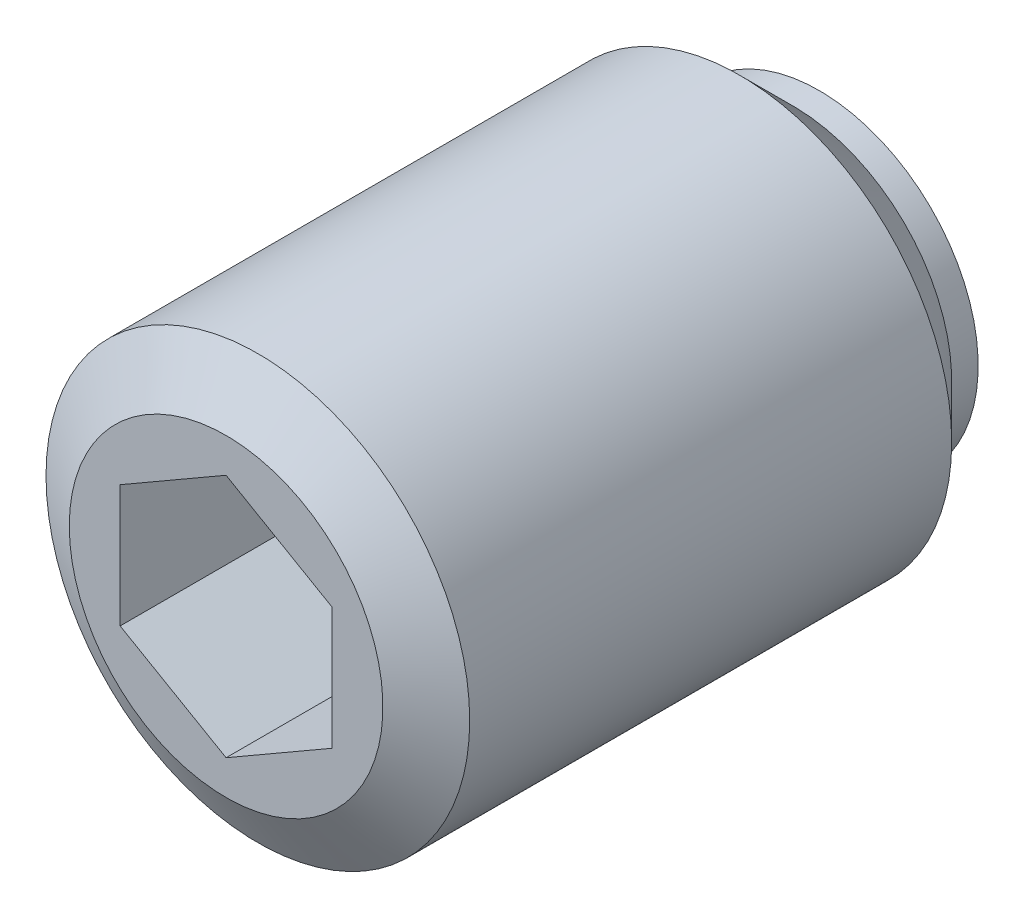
ISO-10303-21;
HEADER;
FILE_DESCRIPTION(('STEP AP214'),'2;1');
FILE_NAME('part.step','',(''),(''),'','','');
FILE_SCHEMA(('AUTOMOTIVE_DESIGN { 1 0 10303 214 1 1 1 1 }'));
ENDSEC;
DATA;
#1=APPLICATION_CONTEXT('core data for automotive mechanical design processes');
#2=APPLICATION_PROTOCOL_DEFINITION('international standard','automotive_design',2000,#1);
#3=PRODUCT_CONTEXT('',#1,'mechanical');
#4=PRODUCT('Part','Part','',(#3));
#5=PRODUCT_RELATED_PRODUCT_CATEGORY('part','',(#4));
#6=PRODUCT_DEFINITION_FORMATION('','',#4);
#7=PRODUCT_DEFINITION_CONTEXT('part definition',#1,'design');
#8=PRODUCT_DEFINITION('design','',#6,#7);
#9=PRODUCT_DEFINITION_SHAPE('','',#8);
#10=(LENGTH_UNIT() NAMED_UNIT(*) SI_UNIT(.MILLI.,.METRE.));
#11=(NAMED_UNIT(*) PLANE_ANGLE_UNIT() SI_UNIT($,.RADIAN.));
#12=(NAMED_UNIT(*) SI_UNIT($,.STERADIAN.) SOLID_ANGLE_UNIT());
#13=UNCERTAINTY_MEASURE_WITH_UNIT(LENGTH_MEASURE(1.E-05),#10,'distance_accuracy_value','');
#14=(GEOMETRIC_REPRESENTATION_CONTEXT(3) GLOBAL_UNCERTAINTY_ASSIGNED_CONTEXT((#13)) GLOBAL_UNIT_ASSIGNED_CONTEXT((#10,
#11,#12)) REPRESENTATION_CONTEXT('',''));
#15=CARTESIAN_POINT('',(0.,0.,0.));
#16=DIRECTION('',(0.,0.,1.));
#17=DIRECTION('',(1.,0.,0.));
#18=AXIS2_PLACEMENT_3D('',#15,#16,#17);
#19=CARTESIAN_POINT('',(0.,0.,1.25));
#20=DIRECTION('',(0.,0.,1.));
#21=DIRECTION('',(0.,-1.,0.));
#22=AXIS2_PLACEMENT_3D('',#19,#20,#21);
#23=SPHERICAL_SURFACE('',#22,1.25);
#24=CARTESIAN_POINT('',(0.,0.,0.4));
#25=DIRECTION('',(0.,0.,1.));
#26=DIRECTION('',(-1.,0.,0.));
#27=AXIS2_PLACEMENT_3D('',#24,#25,#26);
#28=CIRCLE('',#27,0.916515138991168);
#29=CARTESIAN_POINT('',(-0.916515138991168,0.,0.4));
#30=VERTEX_POINT('',#29);
#31=EDGE_CURVE('E9',#30,#30,#28,.T.);
#32=ORIENTED_EDGE('',*,*,#31,.F.);
#33=EDGE_LOOP('',(#32));
#34=FACE_BOUND('',#33,.T.);
#35=ADVANCED_FACE('F14',(#34),#23,.T.);
#36=CARTESIAN_POINT('',(0.,1.5,0.4));
#37=DIRECTION('',(0.,0.,1.));
#38=DIRECTION('',(-1.,0.,0.));
#39=AXIS2_PLACEMENT_3D('',#36,#37,#38);
#40=PLANE('',#39);
#41=CARTESIAN_POINT('',(0.,0.,0.4));
#42=DIRECTION('',(0.,0.,1.));
#43=DIRECTION('',(-1.,0.,0.));
#44=AXIS2_PLACEMENT_3D('',#41,#42,#43);
#45=CIRCLE('',#44,1.5);
#46=CARTESIAN_POINT('',(-1.5,0.,0.4));
#47=VERTEX_POINT('',#46);
#48=EDGE_CURVE('E21',#47,#47,#45,.T.);
#49=ORIENTED_EDGE('',*,*,#48,.F.);
#50=EDGE_LOOP('',(#49));
#51=FACE_BOUND('',#50,.T.);
#52=ORIENTED_EDGE('',*,*,#31,.T.);
#53=EDGE_LOOP('',(#52));
#54=FACE_BOUND('',#53,.T.);
#55=ADVANCED_FACE('F138',(#51,#54),#40,.F.);
#56=CARTESIAN_POINT('',(0.,0.,7.39507492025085));
#57=DIRECTION('',(0.,0.,1.));
#58=DIRECTION('',(-1.,0.,0.));
#59=AXIS2_PLACEMENT_3D('',#56,#57,#58);
#60=CYLINDRICAL_SURFACE('',#59,1.5);
#61=CARTESIAN_POINT('',(0.,0.,0.65));
#62=DIRECTION('',(0.,0.,1.));
#63=DIRECTION('',(-1.,0.,0.));
#64=AXIS2_PLACEMENT_3D('',#61,#62,#63);
#65=CIRCLE('',#64,1.5);
#66=CARTESIAN_POINT('',(-1.5,0.,0.65));
#67=VERTEX_POINT('',#66);
#68=EDGE_CURVE('E131',#67,#67,#65,.T.);
#69=ORIENTED_EDGE('',*,*,#68,.F.);
#70=EDGE_LOOP('',(#69));
#71=FACE_BOUND('',#70,.T.);
#72=ORIENTED_EDGE('',*,*,#48,.T.);
#73=EDGE_LOOP('',(#72));
#74=FACE_BOUND('',#73,.T.);
#75=ADVANCED_FACE('F136',(#71,#74),#60,.T.);
#76=CARTESIAN_POINT('',(0.,0.,0.65));
#77=DIRECTION('',(0.,0.,1.));
#78=DIRECTION('',(-1.,0.,0.));
#79=AXIS2_PLACEMENT_3D('',#76,#77,#78);
#80=CONICAL_SURFACE('',#79,1.5,0.785398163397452);
#81=CARTESIAN_POINT('',(0.,0.,1.15));
#82=DIRECTION('',(0.,0.,1.));
#83=DIRECTION('',(-1.,0.,0.));
#84=AXIS2_PLACEMENT_3D('',#81,#82,#83);
#85=CIRCLE('',#84,2.);
#86=CARTESIAN_POINT('',(-2.,0.,1.15));
#87=VERTEX_POINT('',#86);
#88=EDGE_CURVE('E128',#87,#87,#85,.T.);
#89=ORIENTED_EDGE('',*,*,#88,.F.);
#90=EDGE_LOOP('',(#89));
#91=FACE_BOUND('',#90,.T.);
#92=ORIENTED_EDGE('',*,*,#68,.T.);
#93=EDGE_LOOP('',(#92));
#94=FACE_BOUND('',#93,.T.);
#95=ADVANCED_FACE('F161',(#91,#94),#80,.T.);
#96=CARTESIAN_POINT('',(0.,0.,7.39507492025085));
#97=DIRECTION('',(0.,0.,1.));
#98=DIRECTION('',(-1.,0.,0.));
#99=AXIS2_PLACEMENT_3D('',#96,#97,#98);
#100=CYLINDRICAL_SURFACE('',#99,2.);
#101=CARTESIAN_POINT('',(0.,0.,5.7));
#102=DIRECTION('',(0.,0.,1.));
#103=DIRECTION('',(-1.,0.,0.));
#104=AXIS2_PLACEMENT_3D('',#101,#102,#103);
#105=CIRCLE('',#104,2.);
#106=CARTESIAN_POINT('',(-2.,0.,5.7));
#107=VERTEX_POINT('',#106);
#108=EDGE_CURVE('E125',#107,#107,#105,.T.);
#109=ORIENTED_EDGE('',*,*,#108,.F.);
#110=EDGE_LOOP('',(#109));
#111=FACE_BOUND('',#110,.T.);
#112=ORIENTED_EDGE('',*,*,#88,.T.);
#113=EDGE_LOOP('',(#112));
#114=FACE_BOUND('',#113,.T.);
#115=ADVANCED_FACE('F170',(#111,#114),#100,.T.);
#116=CARTESIAN_POINT('',(0.,0.,5.7));
#117=DIRECTION('',(0.,0.,-1.));
#118=DIRECTION('',(1.,0.,0.));
#119=AXIS2_PLACEMENT_3D('',#116,#117,#118);
#120=CONICAL_SURFACE('',#119,2.,1.04719755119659);
#121=CARTESIAN_POINT('',(0.,0.,6.));
#122=DIRECTION('',(0.,0.,1.));
#123=DIRECTION('',(-1.,0.,0.));
#124=AXIS2_PLACEMENT_3D('',#121,#122,#123);
#125=CIRCLE('',#124,1.48038475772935);
#126=CARTESIAN_POINT('',(-1.48038475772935,0.,6.));
#127=VERTEX_POINT('',#126);
#128=EDGE_CURVE('E116',#127,#127,#125,.T.);
#129=ORIENTED_EDGE('',*,*,#128,.F.);
#130=EDGE_LOOP('',(#129));
#131=FACE_BOUND('',#130,.T.);
#132=ORIENTED_EDGE('',*,*,#108,.T.);
#133=EDGE_LOOP('',(#132));
#134=FACE_BOUND('',#133,.T.);
#135=ADVANCED_FACE('F179',(#131,#134),#120,.T.);
#136=CARTESIAN_POINT('',(0.,0.,6.));
#137=DIRECTION('',(0.,0.,-1.));
#138=DIRECTION('',(1.,0.,0.));
#139=AXIS2_PLACEMENT_3D('',#136,#137,#138);
#140=PLANE('',#139);
#141=DIRECTION('',(-0.866025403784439,-0.5,0.));
#142=VECTOR('',#141,1.);
#143=CARTESIAN_POINT('',(0.,1.15470053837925,6.));
#144=LINE('',#143,#142);
#145=CARTESIAN_POINT('',(0.,1.15470053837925,6.));
#146=VERTEX_POINT('',#145);
#147=CARTESIAN_POINT('',(-1.,0.577350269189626,6.));
#148=VERTEX_POINT('',#147);
#149=EDGE_CURVE('E82',#146,#148,#144,.T.);
#150=ORIENTED_EDGE('',*,*,#149,.F.);
#151=DIRECTION('',(-0.866025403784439,0.5,0.));
#152=VECTOR('',#151,1.);
#153=CARTESIAN_POINT('',(1.,0.577350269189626,6.));
#154=LINE('',#153,#152);
#155=CARTESIAN_POINT('',(1.,0.577350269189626,6.));
#156=VERTEX_POINT('',#155);
#157=EDGE_CURVE('E28',#156,#146,#154,.T.);
#158=ORIENTED_EDGE('',*,*,#157,.F.);
#159=DIRECTION('',(0.,1.,0.));
#160=VECTOR('',#159,1.);
#161=CARTESIAN_POINT('',(1.,-0.577350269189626,6.));
#162=LINE('',#161,#160);
#163=CARTESIAN_POINT('',(1.,-0.577350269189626,6.));
#164=VERTEX_POINT('',#163);
#165=EDGE_CURVE('E98',#164,#156,#162,.T.);
#166=ORIENTED_EDGE('',*,*,#165,.F.);
#167=DIRECTION('',(0.866025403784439,0.5,0.));
#168=VECTOR('',#167,1.);
#169=CARTESIAN_POINT('',(0.,-1.15470053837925,6.));
#170=LINE('',#169,#168);
#171=CARTESIAN_POINT('',(0.,-1.15470053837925,6.));
#172=VERTEX_POINT('',#171);
#173=EDGE_CURVE('E92',#172,#164,#170,.T.);
#174=ORIENTED_EDGE('',*,*,#173,.F.);
#175=DIRECTION('',(0.866025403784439,-0.5,0.));
#176=VECTOR('',#175,1.);
#177=CARTESIAN_POINT('',(-1.,-0.577350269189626,6.));
#178=LINE('',#177,#176);
#179=CARTESIAN_POINT('',(-1.,-0.577350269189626,6.));
#180=VERTEX_POINT('',#179);
#181=EDGE_CURVE('E90',#180,#172,#178,.T.);
#182=ORIENTED_EDGE('',*,*,#181,.F.);
#183=DIRECTION('',(0.,-1.,0.));
#184=VECTOR('',#183,1.);
#185=CARTESIAN_POINT('',(-1.,0.577350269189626,6.));
#186=LINE('',#185,#184);
#187=EDGE_CURVE('E71',#148,#180,#186,.T.);
#188=ORIENTED_EDGE('',*,*,#187,.F.);
#189=EDGE_LOOP('',(#150,#158,#166,#174,#182,#188));
#190=FACE_BOUND('',#189,.T.);
#191=ORIENTED_EDGE('',*,*,#128,.T.);
#192=EDGE_LOOP('',(#191));
#193=FACE_BOUND('',#192,.T.);
#194=ADVANCED_FACE('F86',(#190,#193),#140,.F.);
#195=CARTESIAN_POINT('',(1.,0.577350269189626,4.));
#196=DIRECTION('',(0.5,0.866025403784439,0.));
#197=DIRECTION('',(0.866025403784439,-0.5,0.));
#198=AXIS2_PLACEMENT_3D('',#195,#196,#197);
#199=PLANE('',#198);
#200=ORIENTED_EDGE('',*,*,#157,.T.);
#201=DIRECTION('',(0.,0.,1.));
#202=VECTOR('',#201,1.);
#203=CARTESIAN_POINT('',(0.,1.15470053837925,4.));
#204=LINE('',#203,#202);
#205=CARTESIAN_POINT('',(0.,1.15470053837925,4.));
#206=VERTEX_POINT('',#205);
#207=EDGE_CURVE('E79',#206,#146,#204,.T.);
#208=ORIENTED_EDGE('',*,*,#207,.F.);
#209=DIRECTION('',(-0.866025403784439,0.5,0.));
#210=VECTOR('',#209,1.);
#211=CARTESIAN_POINT('',(1.,0.577350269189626,4.));
#212=LINE('',#211,#210);
#213=CARTESIAN_POINT('',(1.,0.577350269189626,4.));
#214=VERTEX_POINT('',#213);
#215=EDGE_CURVE('E100',#214,#206,#212,.T.);
#216=ORIENTED_EDGE('',*,*,#215,.F.);
#217=DIRECTION('',(0.,0.,1.));
#218=VECTOR('',#217,1.);
#219=CARTESIAN_POINT('',(1.,0.577350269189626,4.));
#220=LINE('',#219,#218);
#221=EDGE_CURVE('E35',#214,#156,#220,.T.);
#222=ORIENTED_EDGE('',*,*,#221,.T.);
#223=EDGE_LOOP('',(#200,#208,#216,#222));
#224=FACE_BOUND('',#223,.T.);
#225=ADVANCED_FACE('F196',(#224),#199,.F.);
#226=CARTESIAN_POINT('',(1.,-0.577350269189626,4.));
#227=DIRECTION('',(1.,0.,0.));
#228=DIRECTION('',(0.,-1.,0.));
#229=AXIS2_PLACEMENT_3D('',#226,#227,#228);
#230=PLANE('',#229);
#231=ORIENTED_EDGE('',*,*,#165,.T.);
#232=ORIENTED_EDGE('',*,*,#221,.F.);
#233=DIRECTION('',(0.,1.,0.));
#234=VECTOR('',#233,1.);
#235=CARTESIAN_POINT('',(1.,-0.577350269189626,4.));
#236=LINE('',#235,#234);
#237=CARTESIAN_POINT('',(1.,-0.577350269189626,4.));
#238=VERTEX_POINT('',#237);
#239=EDGE_CURVE('E112',#238,#214,#236,.T.);
#240=ORIENTED_EDGE('',*,*,#239,.F.);
#241=DIRECTION('',(0.,0.,1.));
#242=VECTOR('',#241,1.);
#243=CARTESIAN_POINT('',(1.,-0.577350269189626,4.));
#244=LINE('',#243,#242);
#245=EDGE_CURVE('E117',#238,#164,#244,.T.);
#246=ORIENTED_EDGE('',*,*,#245,.T.);
#247=EDGE_LOOP('',(#231,#232,#240,#246));
#248=FACE_BOUND('',#247,.T.);
#249=ADVANCED_FACE('F204',(#248),#230,.F.);
#250=CARTESIAN_POINT('',(0.,-1.15470053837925,4.));
#251=DIRECTION('',(0.5,-0.866025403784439,0.));
#252=DIRECTION('',(-0.866025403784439,-0.5,0.));
#253=AXIS2_PLACEMENT_3D('',#250,#251,#252);
#254=PLANE('',#253);
#255=ORIENTED_EDGE('',*,*,#173,.T.);
#256=ORIENTED_EDGE('',*,*,#245,.F.);
#257=DIRECTION('',(0.866025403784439,0.5,0.));
#258=VECTOR('',#257,1.);
#259=CARTESIAN_POINT('',(0.,-1.15470053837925,4.));
#260=LINE('',#259,#258);
#261=CARTESIAN_POINT('',(0.,-1.15470053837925,4.));
#262=VERTEX_POINT('',#261);
#263=EDGE_CURVE('E109',#262,#238,#260,.T.);
#264=ORIENTED_EDGE('',*,*,#263,.F.);
#265=DIRECTION('',(0.,0.,1.));
#266=VECTOR('',#265,1.);
#267=CARTESIAN_POINT('',(0.,-1.15470053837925,4.));
#268=LINE('',#267,#266);
#269=EDGE_CURVE('E119',#262,#172,#268,.T.);
#270=ORIENTED_EDGE('',*,*,#269,.T.);
#271=EDGE_LOOP('',(#255,#256,#264,#270));
#272=FACE_BOUND('',#271,.T.);
#273=ADVANCED_FACE('F212',(#272),#254,.F.);
#274=CARTESIAN_POINT('',(-1.,-0.577350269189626,4.));
#275=DIRECTION('',(-0.5,-0.866025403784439,0.));
#276=DIRECTION('',(-0.866025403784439,0.5,0.));
#277=AXIS2_PLACEMENT_3D('',#274,#275,#276);
#278=PLANE('',#277);
#279=ORIENTED_EDGE('',*,*,#181,.T.);
#280=ORIENTED_EDGE('',*,*,#269,.F.);
#281=DIRECTION('',(0.866025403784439,-0.5,0.));
#282=VECTOR('',#281,1.);
#283=CARTESIAN_POINT('',(-1.,-0.577350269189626,4.));
#284=LINE('',#283,#282);
#285=CARTESIAN_POINT('',(-1.,-0.577350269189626,4.));
#286=VERTEX_POINT('',#285);
#287=EDGE_CURVE('E106',#286,#262,#284,.T.);
#288=ORIENTED_EDGE('',*,*,#287,.F.);
#289=DIRECTION('',(0.,0.,1.));
#290=VECTOR('',#289,1.);
#291=CARTESIAN_POINT('',(-1.,-0.577350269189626,4.));
#292=LINE('',#291,#290);
#293=EDGE_CURVE('E78',#286,#180,#292,.T.);
#294=ORIENTED_EDGE('',*,*,#293,.T.);
#295=EDGE_LOOP('',(#279,#280,#288,#294));
#296=FACE_BOUND('',#295,.T.);
#297=ADVANCED_FACE('F220',(#296),#278,.F.);
#298=CARTESIAN_POINT('',(-1.,0.577350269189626,4.));
#299=DIRECTION('',(-1.,0.,0.));
#300=DIRECTION('',(0.,1.,0.));
#301=AXIS2_PLACEMENT_3D('',#298,#299,#300);
#302=PLANE('',#301);
#303=ORIENTED_EDGE('',*,*,#187,.T.);
#304=ORIENTED_EDGE('',*,*,#293,.F.);
#305=DIRECTION('',(0.,-1.,0.));
#306=VECTOR('',#305,1.);
#307=CARTESIAN_POINT('',(-1.,0.577350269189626,4.));
#308=LINE('',#307,#306);
#309=CARTESIAN_POINT('',(-1.,0.577350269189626,4.));
#310=VERTEX_POINT('',#309);
#311=EDGE_CURVE('E74',#310,#286,#308,.T.);
#312=ORIENTED_EDGE('',*,*,#311,.F.);
#313=DIRECTION('',(0.,0.,1.));
#314=VECTOR('',#313,1.);
#315=CARTESIAN_POINT('',(-1.,0.577350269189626,4.));
#316=LINE('',#315,#314);
#317=EDGE_CURVE('E67',#310,#148,#316,.T.);
#318=ORIENTED_EDGE('',*,*,#317,.T.);
#319=EDGE_LOOP('',(#303,#304,#312,#318));
#320=FACE_BOUND('',#319,.T.);
#321=ADVANCED_FACE('F69',(#320),#302,.F.);
#322=CARTESIAN_POINT('',(0.,1.15470053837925,4.));
#323=DIRECTION('',(-0.5,0.866025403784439,0.));
#324=DIRECTION('',(0.866025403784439,0.5,0.));
#325=AXIS2_PLACEMENT_3D('',#322,#323,#324);
#326=PLANE('',#325);
#327=ORIENTED_EDGE('',*,*,#149,.T.);
#328=ORIENTED_EDGE('',*,*,#317,.F.);
#329=DIRECTION('',(-0.866025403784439,-0.5,0.));
#330=VECTOR('',#329,1.);
#331=CARTESIAN_POINT('',(0.,1.15470053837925,4.));
#332=LINE('',#331,#330);
#333=EDGE_CURVE('E103',#206,#310,#332,.T.);
#334=ORIENTED_EDGE('',*,*,#333,.F.);
#335=ORIENTED_EDGE('',*,*,#207,.T.);
#336=EDGE_LOOP('',(#327,#328,#334,#335));
#337=FACE_BOUND('',#336,.T.);
#338=ADVANCED_FACE('F83',(#337),#326,.F.);
#339=CARTESIAN_POINT('',(0.,1.15470053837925,4.));
#340=DIRECTION('',(0.,0.,1.));
#341=DIRECTION('',(-1.,0.,0.));
#342=AXIS2_PLACEMENT_3D('',#339,#340,#341);
#343=PLANE('',#342);
#344=ORIENTED_EDGE('',*,*,#215,.T.);
#345=ORIENTED_EDGE('',*,*,#333,.T.);
#346=ORIENTED_EDGE('',*,*,#311,.T.);
#347=ORIENTED_EDGE('',*,*,#287,.T.);
#348=ORIENTED_EDGE('',*,*,#263,.T.);
#349=ORIENTED_EDGE('',*,*,#239,.T.);
#350=EDGE_LOOP('',(#344,#345,#346,#347,#348,#349));
#351=FACE_BOUND('',#350,.T.);
#352=ADVANCED_FACE('F244',(#351),#343,.T.);
#353=CLOSED_SHELL('',(#35,#55,#75,#95,#115,#135,#194,#225,#249,#273,#297,#321,#338,#352));
#354=MANIFOLD_SOLID_BREP('B1',#353);
#355=ADVANCED_BREP_SHAPE_REPRESENTATION('',(#18,#354),#14);
#356=SHAPE_DEFINITION_REPRESENTATION(#9,#355);
ENDSEC;
END-ISO-10303-21;
